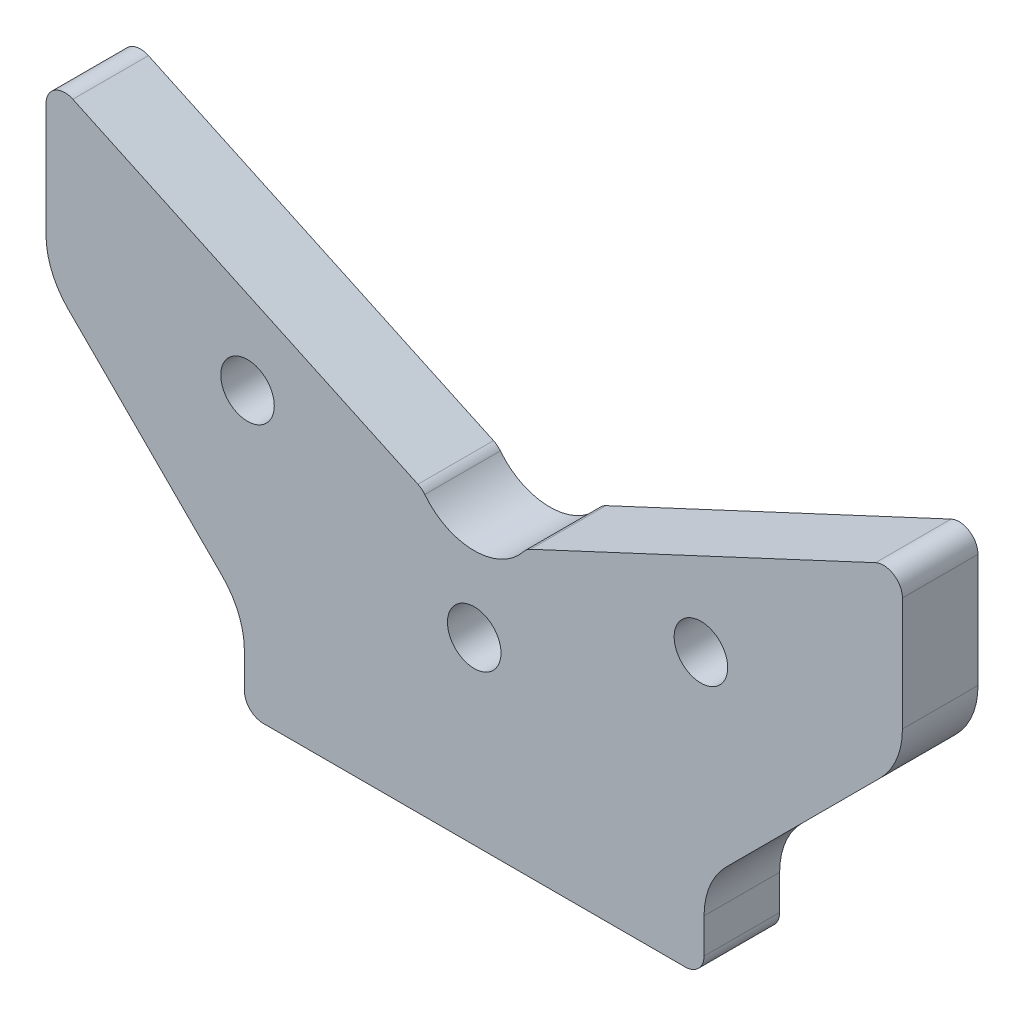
from build123d import *

# Parameters (mm, degrees)
EXTRUDE1_DEPTH         = 12
M10_GEVINDHULLER_D     = 8.5
M10_GEVINDHULLER_DEPTH = 22
M10_GEVINDHULLER_TIP   = 2.553657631


with BuildPart() as part:
    # Sketch1 → Extrude1 (new body)
    with BuildSketch(Plane.XY):
        with BuildLine():
            Line((36.5, 3), (36.5, 8.529437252))
            ThreePointArc((36.5, 8.529437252), (37.41344561, 13.12163844), (40.014718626, 17.014718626))
            Line((40.014718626, 17.014718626), (64.485281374, 41.485281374))
            ThreePointArc((64.485281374, 41.485281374), (67.08655439, 45.37836156), (68, 49.970562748))
            Line((68, 49.970562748), (68, 68))
            ThreePointArc((68, 68), (66.611898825, 70.530174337), (63.732145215, 70.718923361))
            Line((63.732145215, 70.718923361), (8.939617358, 45.168748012))
            ThreePointArc((8.939617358, 45.168748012), (8.345295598, 44.801908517), (7.851901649, 44.307588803))
            ThreePointArc((7.851901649, 44.307588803), (0, 40.500135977), (-7.851901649, 44.307588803))
            ThreePointArc((-7.851901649, 44.307588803), (-8.345295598, 44.801908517), (-8.939617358, 45.168748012))
            Line((-8.939617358, 45.168748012), (-63.732145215, 70.718923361))
            ThreePointArc((-63.732145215, 70.718923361), (-66.611898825, 70.530174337), (-68, 68))
            Line((-68, 68), (-68, 49.970562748))
            ThreePointArc((-68, 49.970562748), (-67.08655439, 45.37836156), (-64.485281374, 41.485281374))
            Line((-64.485281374, 41.485281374), (-40.014718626, 17.014718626))
            ThreePointArc((-40.014718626, 17.014718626), (-37.41344561, 13.12163844), (-36.5, 8.529437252))
            Line((-36.5, 8.529437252), (-36.5, 3))
            ThreePointArc((-36.5, 3), (-35.621320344, 0.878679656), (-33.5, 0))
            Line((-33.5, 0), (0, 0))
            Line((0, 0), (33.5, 0))
            ThreePointArc((33.5, 0), (35.621320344, 0.878679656), (36.5, 3))
        make_face()
    extrude(amount=EXTRUDE1_DEPTH)

    # M10 gevindhuller
    with Locations(Plane.XY.offset(12)):
        with Locations((-36, 44.546676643), (0, 28.546676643), (36, 44.546676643)):
            Hole(M10_GEVINDHULLER_D / 2, depth=M10_GEVINDHULLER_DEPTH)
            with Locations((0, 0, -(M10_GEVINDHULLER_DEPTH + M10_GEVINDHULLER_TIP / 2))):  # 118° drill point
                Cone(0, M10_GEVINDHULLER_D / 2, M10_GEVINDHULLER_TIP, mode=Mode.SUBTRACT)


solid = part.part
